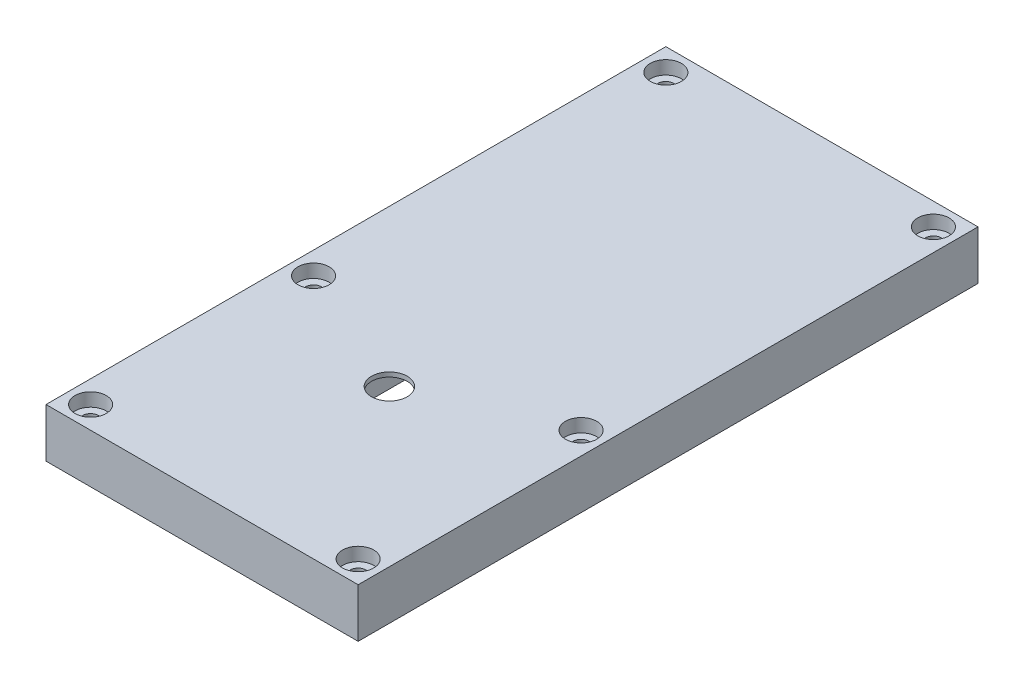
from build123d import *

# Parameters (mm, degrees)
SKETCH_1_W          = 70
SKETCH_1_H          = 139
EXTRUDE_1_DEPTH     = 11
SKETCH_3_R          = 4
CUT_EXTRUDE_1_DEPTH = 10
SKETCH_4_R          = 1.75
CUT_EXTRUDE_2_DEPTH = 79.589121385
SKETCH_6_W          = 20.5
SKETCH_6_H          = 4
EXTRUDE_3_DEPTH     = 12.75
SKETCH_7_W          = 21
SKETCH_7_H          = 103
CUT_EXTRUDE_3_DEPTH = 10
SKETCH_8_R          = 3.5
CUT_EXTRUDE_4_DEPTH = 3


with BuildPart() as part:
    # Sketch 1 → Extrude 1 (new body)
    with BuildSketch(Plane(origin=(0, 0, 0), x_dir=(1, 0, 0), z_dir=(0, 1, 0))):
        Rectangle(SKETCH_1_W, SKETCH_1_H)
    extrude(amount=EXTRUDE_1_DEPTH)

    # Sketch 3 → Cut-Extrude 1 (cut)
    with BuildSketch(Plane(origin=(0, 11, 0), x_dir=(1, 0, 0), z_dir=(0, 1, 0))):
        with Locations(Location((0, -27.5, 0), (0, 0, 270))):
            Circle(SKETCH_3_R)
    extrude(amount=-CUT_EXTRUDE_1_DEPTH, mode=Mode.SUBTRACT)

    # Sketch 4 → Cut-Extrude 2 (cut, through all)
    with BuildSketch(Plane(origin=(0, 11, 0), x_dir=(1, 0, 0), z_dir=(0, 1, 0))):
        with Locations(Location((-30, 64.5, 0), (0, 0, 270))):
            Circle(SKETCH_4_R)
        with Locations(Location((30, 64.5, 0), (0, 0, 270))):
            Circle(SKETCH_4_R)
        with Locations(Location((-30, -14.5, 0), (0, 0, 270))):
            Circle(SKETCH_4_R)
        with Locations(Location((30, -14.5, 0), (0, 0, 270))):
            Circle(SKETCH_4_R)
        with Locations(Location((30, -64.5, 0), (0, 0, 270))):
            Circle(SKETCH_4_R)
        with Locations(Location((-30, -64.5, 0), (0, 0, 270))):
            Circle(SKETCH_4_R)
    extrude(amount=-CUT_EXTRUDE_2_DEPTH, mode=Mode.SUBTRACT)

    # Sketch 6 → Extrude 3 (add)
    with BuildSketch(Plane.XZ):
        with Locations((0, -67.5)):
            Rectangle(SKETCH_6_W, SKETCH_6_H)
    extrude(amount=EXTRUDE_3_DEPTH)

    # Sketch 7 → Cut-Extrude 3 (cut)
    with BuildSketch(Plane.XZ):
        with Locations((0, -14)):
            Rectangle(SKETCH_7_W, SKETCH_7_H)
    extrude(amount=-CUT_EXTRUDE_3_DEPTH, mode=Mode.SUBTRACT)

    # Sketch 8 → Cut-Extrude 4 (cut)
    with BuildSketch(Plane(origin=(0, 11, 0), x_dir=(1, 0, 0), z_dir=(0, 1, 0))):
        with Locations(Location((-30, 64.5, 0), (0, 0, 270))):
            Circle(SKETCH_8_R)
        with Locations(Location((30, 64.5, 0), (0, 0, 270))):
            Circle(SKETCH_8_R)
        with Locations(Location((-30, -14.5, 0), (0, 0, 270))):
            Circle(SKETCH_8_R)
        with Locations(Location((30, -14.5, 0), (0, 0, 270))):
            Circle(SKETCH_8_R)
        with Locations(Location((-30, -64.5, 0), (0, 0, 270))):
            Circle(SKETCH_8_R)
        with Locations(Location((30, -64.5, 0), (0, 0, 270))):
            Circle(SKETCH_8_R)
    extrude(amount=-CUT_EXTRUDE_4_DEPTH, mode=Mode.SUBTRACT)


solid = part.part
